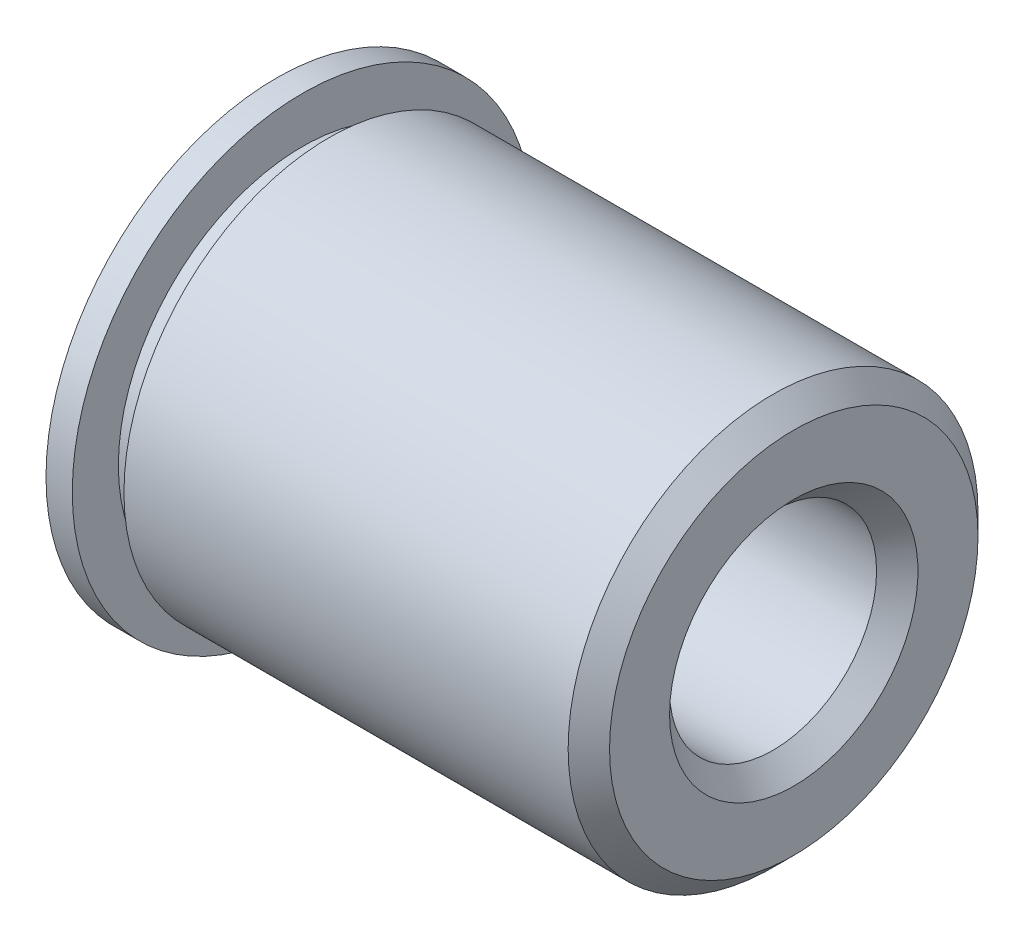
from build123d import *

# Parameters (mm, degrees)
SKETCH2_R          = 1
CUT_EXTRUDE1_DEPTH = 6.90772799
CHAMFER1_SIZE      = 0.2
CHAMFER2_SIZE      = 0.2


with BuildPart() as part:
    # Sketch1 → Revolve1 (revolve)
    with BuildSketch(Plane.XY, mode=Mode.PRIVATE) as revolve1_sk:
        Polygon((74.213672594, 0), (74.213672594, 1.98), (69.721672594, 1.98), (69.721672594, 1.78), (69.467672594, 1.78), (69.467672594, 2.225), (69.213672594, 2.225), (69.213672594, 0), align=None)
    revolve(revolve1_sk.sketch.rotate(Axis((-67.824902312, 0, 0), (1, 0, 0)), 90), axis=Axis((-67.824902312, 0, 0), (1, 0, 0)))

    # Sketch2 → Cut-Extrude1 (cut, through all)
    with BuildSketch(Plane(origin=(74.213672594, 0, 0), x_dir=(0, 0, -1), z_dir=(1, 0, 0))):
        Circle(SKETCH2_R)
    extrude(amount=-CUT_EXTRUDE1_DEPTH, mode=Mode.SUBTRACT)

    # Chamfer1
    chamfer1_edges = [part.edges().sort_by_distance(p)[0] for p in [
        (74.213672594, 0, -1.98),
    ]]
    chamfer(chamfer1_edges, length=CHAMFER1_SIZE)

    # Chamfer2
    chamfer2_edges = [part.edges().sort_by_distance(p)[0] for p in [
        (69.213672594, 0, 1),
        (74.213672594, 0, 1),
    ]]
    chamfer(chamfer2_edges, length=CHAMFER2_SIZE)


solid = part.part
